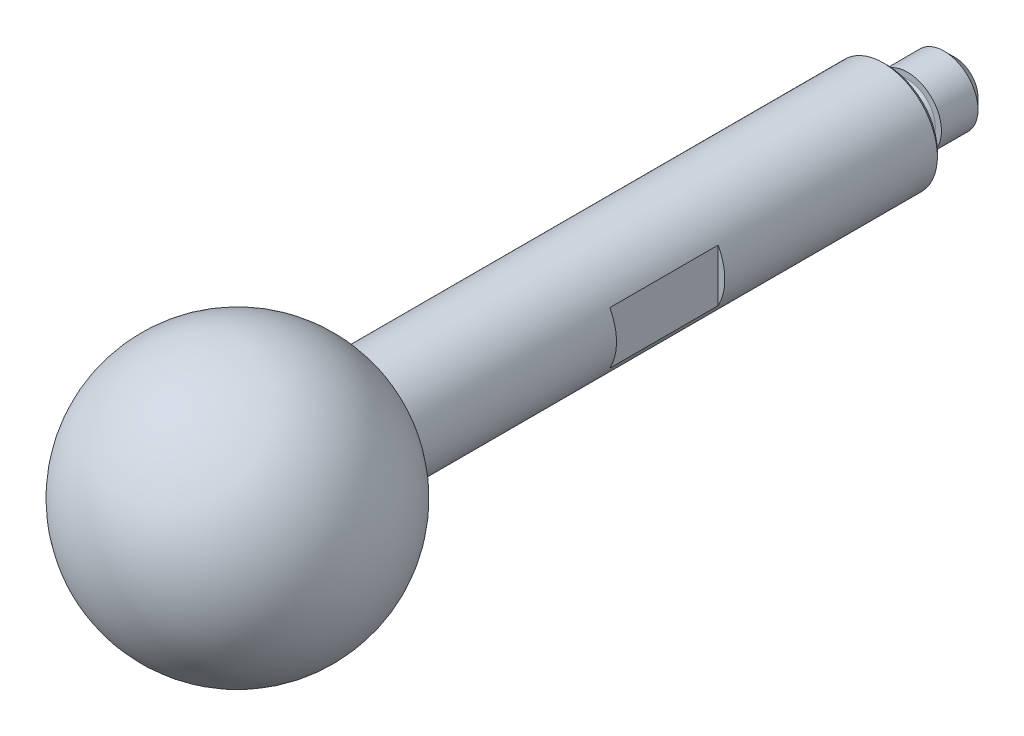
ISO-10303-21;
HEADER;
FILE_DESCRIPTION(('STEP AP214'),'2;1');
FILE_NAME('part.step','',(''),(''),'','','');
FILE_SCHEMA(('AUTOMOTIVE_DESIGN { 1 0 10303 214 1 1 1 1 }'));
ENDSEC;
DATA;
#1=APPLICATION_CONTEXT('core data for automotive mechanical design processes');
#2=APPLICATION_PROTOCOL_DEFINITION('international standard','automotive_design',2000,#1);
#3=PRODUCT_CONTEXT('',#1,'mechanical');
#4=PRODUCT('Part','Part','',(#3));
#5=PRODUCT_RELATED_PRODUCT_CATEGORY('part','',(#4));
#6=PRODUCT_DEFINITION_FORMATION('','',#4);
#7=PRODUCT_DEFINITION_CONTEXT('part definition',#1,'design');
#8=PRODUCT_DEFINITION('design','',#6,#7);
#9=PRODUCT_DEFINITION_SHAPE('','',#8);
#10=(LENGTH_UNIT() NAMED_UNIT(*) SI_UNIT(.MILLI.,.METRE.));
#11=(NAMED_UNIT(*) PLANE_ANGLE_UNIT() SI_UNIT($,.RADIAN.));
#12=(NAMED_UNIT(*) SI_UNIT($,.STERADIAN.) SOLID_ANGLE_UNIT());
#13=UNCERTAINTY_MEASURE_WITH_UNIT(LENGTH_MEASURE(1.E-05),#10,'distance_accuracy_value','');
#14=(GEOMETRIC_REPRESENTATION_CONTEXT(3) GLOBAL_UNCERTAINTY_ASSIGNED_CONTEXT((#13)) GLOBAL_UNIT_ASSIGNED_CONTEXT((#10,
#11,#12)) REPRESENTATION_CONTEXT('',''));
#15=CARTESIAN_POINT('',(0.,0.,0.));
#16=DIRECTION('',(0.,0.,1.));
#17=DIRECTION('',(1.,0.,0.));
#18=AXIS2_PLACEMENT_3D('',#15,#16,#17);
#19=CARTESIAN_POINT('',(0.,0.,0.));
#20=DIRECTION('',(0.,0.,-1.));
#21=DIRECTION('',(-1.,0.,0.));
#22=AXIS2_PLACEMENT_3D('',#19,#20,#21);
#23=PLANE('',#22);
#24=CARTESIAN_POINT('',(0.,0.,0.));
#25=DIRECTION('',(0.,0.,-1.));
#26=DIRECTION('',(-1.,0.,0.));
#27=AXIS2_PLACEMENT_3D('',#24,#25,#26);
#28=CIRCLE('',#27,3.7);
#29=CARTESIAN_POINT('',(-3.7,0.,0.));
#30=VERTEX_POINT('',#29);
#31=EDGE_CURVE('E22',#30,#30,#28,.T.);
#32=ORIENTED_EDGE('',*,*,#31,.T.);
#33=EDGE_LOOP('',(#32));
#34=FACE_BOUND('',#33,.T.);
#35=CARTESIAN_POINT('',(0.,0.,0.));
#36=DIRECTION('',(0.,0.,-1.));
#37=DIRECTION('',(-1.,0.,0.));
#38=AXIS2_PLACEMENT_3D('',#35,#36,#37);
#39=CIRCLE('',#38,2.05);
#40=CARTESIAN_POINT('',(-2.05,0.,0.));
#41=VERTEX_POINT('',#40);
#42=EDGE_CURVE('E81',#41,#41,#39,.T.);
#43=ORIENTED_EDGE('',*,*,#42,.F.);
#44=EDGE_LOOP('',(#43));
#45=FACE_BOUND('',#44,.T.);
#46=ADVANCED_FACE('F14',(#34,#45),#23,.T.);
#47=CARTESIAN_POINT('',(5.66262459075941,1.98360347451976,40.));
#48=DIRECTION('',(0.,0.,1.));
#49=DIRECTION('',(0.330600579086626,-0.943770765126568,0.));
#50=AXIS2_PLACEMENT_3D('',#47,#48,#49);
#51=PLANE('',#50);
#52=CARTESIAN_POINT('',(0.,0.,40.));
#53=DIRECTION('',(0.,0.,-1.));
#54=DIRECTION('',(-0.330600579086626,0.943770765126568,0.));
#55=AXIS2_PLACEMENT_3D('',#52,#53,#54);
#56=CIRCLE('',#55,6.);
#57=CARTESIAN_POINT('',(-1.98360347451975,5.66262459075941,40.));
#58=VERTEX_POINT('',#57);
#59=EDGE_CURVE('E72',#58,#58,#56,.T.);
#60=ORIENTED_EDGE('',*,*,#59,.T.);
#61=EDGE_LOOP('',(#60));
#62=FACE_BOUND('',#61,.T.);
#63=CARTESIAN_POINT('',(0.,0.,40.));
#64=DIRECTION('',(0.,0.,-1.));
#65=DIRECTION('',(-1.,0.,0.));
#66=AXIS2_PLACEMENT_3D('',#63,#64,#65);
#67=CIRCLE('',#66,4.);
#68=CARTESIAN_POINT('',(-4.,0.,40.));
#69=VERTEX_POINT('',#68);
#70=EDGE_CURVE('E75',#69,#69,#67,.T.);
#71=ORIENTED_EDGE('',*,*,#70,.F.);
#72=EDGE_LOOP('',(#71));
#73=FACE_BOUND('',#72,.T.);
#74=ADVANCED_FACE('F103',(#62,#73),#51,.F.);
#75=CARTESIAN_POINT('',(0.,0.,48.));
#76=DIRECTION('',(0.,0.,-1.));
#77=DIRECTION('',(0.943770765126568,0.330600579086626,0.));
#78=AXIS2_PLACEMENT_3D('',#75,#76,#77);
#79=SPHERICAL_SURFACE('',#78,10.);
#80=ORIENTED_EDGE('',*,*,#59,.F.);
#81=EDGE_LOOP('',(#80));
#82=FACE_BOUND('',#81,.T.);
#83=ADVANCED_FACE('F108',(#82),#79,.T.);
#84=CARTESIAN_POINT('',(3.5,2.,24.));
#85=DIRECTION('',(0.,0.,-1.));
#86=DIRECTION('',(-1.,0.,0.));
#87=AXIS2_PLACEMENT_3D('',#84,#85,#86);
#88=PLANE('',#87);
#89=DIRECTION('',(0.,1.,0.));
#90=VECTOR('',#89,1.);
#91=CARTESIAN_POINT('',(3.5,2.,24.));
#92=LINE('',#91,#90);
#93=CARTESIAN_POINT('',(3.5,-1.93649167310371,24.));
#94=VERTEX_POINT('',#93);
#95=CARTESIAN_POINT('',(3.5,1.93649167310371,24.));
#96=VERTEX_POINT('',#95);
#97=EDGE_CURVE('E29',#94,#96,#92,.T.);
#98=ORIENTED_EDGE('',*,*,#97,.T.);
#99=CARTESIAN_POINT('',(0.,0.,24.));
#100=DIRECTION('',(0.,0.,-1.));
#101=DIRECTION('',(-1.,0.,0.));
#102=AXIS2_PLACEMENT_3D('',#99,#100,#101);
#103=CIRCLE('',#102,4.);
#104=EDGE_CURVE('E65',#96,#94,#103,.T.);
#105=ORIENTED_EDGE('',*,*,#104,.T.);
#106=EDGE_LOOP('',(#98,#105));
#107=FACE_BOUND('',#106,.T.);
#108=ADVANCED_FACE('F130',(#107),#88,.T.);
#109=CARTESIAN_POINT('',(3.5,2.,16.));
#110=DIRECTION('',(0.,0.,1.));
#111=DIRECTION('',(1.,0.,0.));
#112=AXIS2_PLACEMENT_3D('',#109,#110,#111);
#113=PLANE('',#112);
#114=CARTESIAN_POINT('',(0.,0.,16.));
#115=DIRECTION('',(0.,0.,1.));
#116=DIRECTION('',(1.,0.,0.));
#117=AXIS2_PLACEMENT_3D('',#114,#115,#116);
#118=CIRCLE('',#117,4.);
#119=CARTESIAN_POINT('',(3.5,-1.93649167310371,16.));
#120=VERTEX_POINT('',#119);
#121=CARTESIAN_POINT('',(3.5,1.93649167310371,16.));
#122=VERTEX_POINT('',#121);
#123=EDGE_CURVE('E57',#120,#122,#118,.T.);
#124=ORIENTED_EDGE('',*,*,#123,.T.);
#125=DIRECTION('',(0.,-1.,0.));
#126=VECTOR('',#125,1.);
#127=CARTESIAN_POINT('',(3.5,2.,16.));
#128=LINE('',#127,#126);
#129=EDGE_CURVE('E60',#122,#120,#128,.T.);
#130=ORIENTED_EDGE('',*,*,#129,.T.);
#131=EDGE_LOOP('',(#124,#130));
#132=FACE_BOUND('',#131,.T.);
#133=ADVANCED_FACE('F59',(#132),#113,.T.);
#134=CARTESIAN_POINT('',(3.5,-2.,16.));
#135=DIRECTION('',(1.,0.,0.));
#136=DIRECTION('',(0.,0.,1.));
#137=AXIS2_PLACEMENT_3D('',#134,#135,#136);
#138=PLANE('',#137);
#139=DIRECTION('',(0.,0.,1.));
#140=VECTOR('',#139,1.);
#141=CARTESIAN_POINT('',(3.5,1.93649167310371,0.));
#142=LINE('',#141,#140);
#143=EDGE_CURVE('E68',#122,#96,#142,.T.);
#144=ORIENTED_EDGE('',*,*,#143,.T.);
#145=ORIENTED_EDGE('',*,*,#97,.F.);
#146=DIRECTION('',(0.,0.,1.));
#147=VECTOR('',#146,1.);
#148=CARTESIAN_POINT('',(3.5,-1.93649167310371,0.));
#149=LINE('',#148,#147);
#150=EDGE_CURVE('E64',#94,#120,#149,.F.);
#151=ORIENTED_EDGE('',*,*,#150,.T.);
#152=ORIENTED_EDGE('',*,*,#129,.F.);
#153=EDGE_LOOP('',(#144,#145,#151,#152));
#154=FACE_BOUND('',#153,.T.);
#155=ADVANCED_FACE('F67',(#154),#138,.T.);
#156=CARTESIAN_POINT('',(-3.5,2.,24.));
#157=DIRECTION('',(0.,0.,1.));
#158=DIRECTION('',(1.,0.,0.));
#159=AXIS2_PLACEMENT_3D('',#156,#157,#158);
#160=PLANE('',#159);
#161=DIRECTION('',(0.,1.,0.));
#162=VECTOR('',#161,1.);
#163=CARTESIAN_POINT('',(-3.5,2.,24.));
#164=LINE('',#163,#162);
#165=CARTESIAN_POINT('',(-3.5,-1.93649167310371,24.));
#166=VERTEX_POINT('',#165);
#167=CARTESIAN_POINT('',(-3.5,1.93649167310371,24.));
#168=VERTEX_POINT('',#167);
#169=EDGE_CURVE('E172',#166,#168,#164,.T.);
#170=ORIENTED_EDGE('',*,*,#169,.F.);
#171=CARTESIAN_POINT('',(0.,0.,24.));
#172=DIRECTION('',(0.,0.,1.));
#173=DIRECTION('',(1.,0.,0.));
#174=AXIS2_PLACEMENT_3D('',#171,#172,#173);
#175=CIRCLE('',#174,4.);
#176=EDGE_CURVE('E36',#168,#166,#175,.T.);
#177=ORIENTED_EDGE('',*,*,#176,.F.);
#178=EDGE_LOOP('',(#170,#177));
#179=FACE_BOUND('',#178,.T.);
#180=ADVANCED_FACE('F126',(#179),#160,.F.);
#181=CARTESIAN_POINT('',(-3.5,-2.,16.));
#182=DIRECTION('',(-1.,0.,0.));
#183=DIRECTION('',(0.,0.,1.));
#184=AXIS2_PLACEMENT_3D('',#181,#182,#183);
#185=PLANE('',#184);
#186=DIRECTION('',(0.,0.,1.));
#187=VECTOR('',#186,1.);
#188=CARTESIAN_POINT('',(-3.5,-1.93649167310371,0.));
#189=LINE('',#188,#187);
#190=CARTESIAN_POINT('',(-3.5,-1.93649167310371,16.));
#191=VERTEX_POINT('',#190);
#192=EDGE_CURVE('E179',#191,#166,#189,.T.);
#193=ORIENTED_EDGE('',*,*,#192,.T.);
#194=ORIENTED_EDGE('',*,*,#169,.T.);
#195=DIRECTION('',(0.,0.,1.));
#196=VECTOR('',#195,1.);
#197=CARTESIAN_POINT('',(-3.5,1.93649167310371,0.));
#198=LINE('',#197,#196);
#199=CARTESIAN_POINT('',(-3.5,1.93649167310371,16.));
#200=VERTEX_POINT('',#199);
#201=EDGE_CURVE('E180',#168,#200,#198,.F.);
#202=ORIENTED_EDGE('',*,*,#201,.T.);
#203=DIRECTION('',(0.,-1.,0.));
#204=VECTOR('',#203,1.);
#205=CARTESIAN_POINT('',(-3.5,2.,16.));
#206=LINE('',#205,#204);
#207=EDGE_CURVE('E175',#200,#191,#206,.T.);
#208=ORIENTED_EDGE('',*,*,#207,.T.);
#209=EDGE_LOOP('',(#193,#194,#202,#208));
#210=FACE_BOUND('',#209,.T.);
#211=ADVANCED_FACE('F124',(#210),#185,.T.);
#212=CARTESIAN_POINT('',(-3.5,2.,16.));
#213=DIRECTION('',(0.,0.,-1.));
#214=DIRECTION('',(-1.,0.,0.));
#215=AXIS2_PLACEMENT_3D('',#212,#213,#214);
#216=PLANE('',#215);
#217=CARTESIAN_POINT('',(0.,0.,16.));
#218=DIRECTION('',(0.,0.,-1.));
#219=DIRECTION('',(-1.,0.,0.));
#220=AXIS2_PLACEMENT_3D('',#217,#218,#219);
#221=CIRCLE('',#220,4.);
#222=EDGE_CURVE('E181',#191,#200,#221,.T.);
#223=ORIENTED_EDGE('',*,*,#222,.F.);
#224=ORIENTED_EDGE('',*,*,#207,.F.);
#225=EDGE_LOOP('',(#223,#224));
#226=FACE_BOUND('',#225,.T.);
#227=ADVANCED_FACE('F115',(#226),#216,.F.);
#228=CARTESIAN_POINT('',(0.,0.,0.));
#229=DIRECTION('',(0.,0.,1.));
#230=DIRECTION('',(1.,0.,0.));
#231=AXIS2_PLACEMENT_3D('',#228,#229,#230);
#232=CYLINDRICAL_SURFACE('',#231,4.);
#233=CARTESIAN_POINT('',(0.,0.,0.3));
#234=DIRECTION('',(0.,0.,-1.));
#235=DIRECTION('',(-1.,0.,0.));
#236=AXIS2_PLACEMENT_3D('',#233,#234,#235);
#237=CIRCLE('',#236,4.);
#238=CARTESIAN_POINT('',(-4.,0.,0.3));
#239=VERTEX_POINT('',#238);
#240=EDGE_CURVE('E9',#239,#239,#237,.F.);
#241=ORIENTED_EDGE('',*,*,#240,.T.);
#242=EDGE_LOOP('',(#241));
#243=FACE_BOUND('',#242,.T.);
#244=ORIENTED_EDGE('',*,*,#222,.T.);
#245=ORIENTED_EDGE('',*,*,#201,.F.);
#246=ORIENTED_EDGE('',*,*,#176,.T.);
#247=ORIENTED_EDGE('',*,*,#192,.F.);
#248=EDGE_LOOP('',(#244,#245,#246,#247));
#249=FACE_BOUND('',#248,.T.);
#250=ORIENTED_EDGE('',*,*,#70,.T.);
#251=EDGE_LOOP('',(#250));
#252=FACE_BOUND('',#251,.T.);
#253=ORIENTED_EDGE('',*,*,#143,.F.);
#254=ORIENTED_EDGE('',*,*,#123,.F.);
#255=ORIENTED_EDGE('',*,*,#150,.F.);
#256=ORIENTED_EDGE('',*,*,#104,.F.);
#257=EDGE_LOOP('',(#253,#254,#255,#256));
#258=FACE_BOUND('',#257,.T.);
#259=ADVANCED_FACE('F71',(#243,#249,#252,#258),#232,.T.);
#260=CARTESIAN_POINT('',(0.,2.05,-1.5));
#261=DIRECTION('',(0.,0.,-1.));
#262=DIRECTION('',(-1.,0.,0.));
#263=AXIS2_PLACEMENT_3D('',#260,#261,#262);
#264=PLANE('',#263);
#265=CARTESIAN_POINT('',(0.,0.,-1.5));
#266=DIRECTION('',(0.,0.,-1.));
#267=DIRECTION('',(-1.,0.,0.));
#268=AXIS2_PLACEMENT_3D('',#265,#266,#267);
#269=CIRCLE('',#268,2.05);
#270=CARTESIAN_POINT('',(-2.05,0.,-1.5));
#271=VERTEX_POINT('',#270);
#272=EDGE_CURVE('E200',#271,#271,#269,.T.);
#273=ORIENTED_EDGE('',*,*,#272,.T.);
#274=EDGE_LOOP('',(#273));
#275=FACE_BOUND('',#274,.T.);
#276=CARTESIAN_POINT('',(0.,0.,-1.5));
#277=DIRECTION('',(0.,0.,-1.));
#278=DIRECTION('',(-1.,0.,0.));
#279=AXIS2_PLACEMENT_3D('',#276,#277,#278);
#280=CIRCLE('',#279,2.5);
#281=CARTESIAN_POINT('',(-2.5,0.,-1.5));
#282=VERTEX_POINT('',#281);
#283=EDGE_CURVE('E69',#282,#282,#280,.T.);
#284=ORIENTED_EDGE('',*,*,#283,.F.);
#285=EDGE_LOOP('',(#284));
#286=FACE_BOUND('',#285,.T.);
#287=ADVANCED_FACE('F114',(#275,#286),#264,.F.);
#288=CARTESIAN_POINT('',(0.,0.,-0.2));
#289=DIRECTION('',(0.,0.,-1.));
#290=DIRECTION('',(-1.,0.,0.));
#291=AXIS2_PLACEMENT_3D('',#288,#289,#290);
#292=TOROIDAL_SURFACE('',#291,2.05,0.2);
#293=CARTESIAN_POINT('',(0.,0.,-0.2));
#294=DIRECTION('',(0.,0.,-1.));
#295=DIRECTION('',(-1.,0.,0.));
#296=AXIS2_PLACEMENT_3D('',#293,#294,#295);
#297=CIRCLE('',#296,1.85);
#298=CARTESIAN_POINT('',(-1.85,0.,-0.2));
#299=VERTEX_POINT('',#298);
#300=EDGE_CURVE('E194',#299,#299,#297,.T.);
#301=ORIENTED_EDGE('',*,*,#300,.F.);
#302=EDGE_LOOP('',(#301));
#303=FACE_BOUND('',#302,.T.);
#304=ORIENTED_EDGE('',*,*,#42,.T.);
#305=EDGE_LOOP('',(#304));
#306=FACE_BOUND('',#305,.T.);
#307=ADVANCED_FACE('F121',(#303,#306),#292,.F.);
#308=CARTESIAN_POINT('',(0.,0.,-5.));
#309=DIRECTION('',(0.,0.,-1.));
#310=DIRECTION('',(-1.,0.,0.));
#311=AXIS2_PLACEMENT_3D('',#308,#309,#310);
#312=CYLINDRICAL_SURFACE('',#311,1.85);
#313=CARTESIAN_POINT('',(0.,0.,-1.3));
#314=DIRECTION('',(0.,0.,-1.));
#315=DIRECTION('',(-1.,0.,0.));
#316=AXIS2_PLACEMENT_3D('',#313,#314,#315);
#317=CIRCLE('',#316,1.85);
#318=CARTESIAN_POINT('',(-1.85,0.,-1.3));
#319=VERTEX_POINT('',#318);
#320=EDGE_CURVE('E197',#319,#319,#317,.T.);
#321=ORIENTED_EDGE('',*,*,#320,.F.);
#322=EDGE_LOOP('',(#321));
#323=FACE_BOUND('',#322,.T.);
#324=ORIENTED_EDGE('',*,*,#300,.T.);
#325=EDGE_LOOP('',(#324));
#326=FACE_BOUND('',#325,.T.);
#327=ADVANCED_FACE('F143',(#323,#326),#312,.T.);
#328=CARTESIAN_POINT('',(0.,0.,-1.3));
#329=DIRECTION('',(0.,0.,-1.));
#330=DIRECTION('',(-1.,0.,0.));
#331=AXIS2_PLACEMENT_3D('',#328,#329,#330);
#332=TOROIDAL_SURFACE('',#331,2.05,0.2);
#333=ORIENTED_EDGE('',*,*,#272,.F.);
#334=EDGE_LOOP('',(#333));
#335=FACE_BOUND('',#334,.T.);
#336=ORIENTED_EDGE('',*,*,#320,.T.);
#337=EDGE_LOOP('',(#336));
#338=FACE_BOUND('',#337,.T.);
#339=ADVANCED_FACE('F138',(#335,#338),#332,.F.);
#340=CARTESIAN_POINT('',(0.,0.,-5.));
#341=DIRECTION('',(0.,0.,1.));
#342=DIRECTION('',(0.,-1.,0.));
#343=AXIS2_PLACEMENT_3D('',#340,#341,#342);
#344=PLANE('',#343);
#345=CARTESIAN_POINT('',(0.,0.,-5.));
#346=DIRECTION('',(0.,0.,1.));
#347=DIRECTION('',(1.,0.,0.));
#348=AXIS2_PLACEMENT_3D('',#345,#346,#347);
#349=CIRCLE('',#348,1.7);
#350=CARTESIAN_POINT('',(1.7,0.,-5.));
#351=VERTEX_POINT('',#350);
#352=EDGE_CURVE('E82',#351,#351,#349,.F.);
#353=ORIENTED_EDGE('',*,*,#352,.T.);
#354=EDGE_LOOP('',(#353));
#355=FACE_BOUND('',#354,.T.);
#356=ADVANCED_FACE('F135',(#355),#344,.F.);
#357=CARTESIAN_POINT('',(0.,0.,15.));
#358=DIRECTION('',(0.,0.,1.));
#359=DIRECTION('',(0.,-1.,0.));
#360=AXIS2_PLACEMENT_3D('',#357,#358,#359);
#361=CYLINDRICAL_SURFACE('',#360,2.5);
#362=CARTESIAN_POINT('',(0.,0.,-4.2));
#363=DIRECTION('',(0.,0.,1.));
#364=DIRECTION('',(1.,0.,0.));
#365=AXIS2_PLACEMENT_3D('',#362,#363,#364);
#366=CIRCLE('',#365,2.5);
#367=CARTESIAN_POINT('',(2.5,0.,-4.2));
#368=VERTEX_POINT('',#367);
#369=EDGE_CURVE('E85',#368,#368,#366,.T.);
#370=ORIENTED_EDGE('',*,*,#369,.T.);
#371=EDGE_LOOP('',(#370));
#372=FACE_BOUND('',#371,.T.);
#373=ORIENTED_EDGE('',*,*,#283,.T.);
#374=EDGE_LOOP('',(#373));
#375=FACE_BOUND('',#374,.T.);
#376=ADVANCED_FACE('F99',(#372,#375),#361,.T.);
#377=CARTESIAN_POINT('',(0.,0.,-5.));
#378=DIRECTION('',(0.,0.,1.));
#379=DIRECTION('',(1.,0.,0.));
#380=AXIS2_PLACEMENT_3D('',#377,#378,#379);
#381=CONICAL_SURFACE('',#380,1.7,0.785398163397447);
#382=ORIENTED_EDGE('',*,*,#369,.F.);
#383=EDGE_LOOP('',(#382));
#384=FACE_BOUND('',#383,.T.);
#385=ORIENTED_EDGE('',*,*,#352,.F.);
#386=EDGE_LOOP('',(#385));
#387=FACE_BOUND('',#386,.T.);
#388=ADVANCED_FACE('F93',(#384,#387),#381,.T.);
#389=CARTESIAN_POINT('',(0.,0.,0.));
#390=DIRECTION('',(0.,0.,1.));
#391=DIRECTION('',(1.,0.,0.));
#392=AXIS2_PLACEMENT_3D('',#389,#390,#391);
#393=CONICAL_SURFACE('',#392,3.7,0.785398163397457);
#394=ORIENTED_EDGE('',*,*,#240,.F.);
#395=EDGE_LOOP('',(#394));
#396=FACE_BOUND('',#395,.T.);
#397=ORIENTED_EDGE('',*,*,#31,.F.);
#398=EDGE_LOOP('',(#397));
#399=FACE_BOUND('',#398,.T.);
#400=ADVANCED_FACE('F16',(#396,#399),#393,.T.);
#401=CLOSED_SHELL('',(#46,#74,#83,#108,#133,#155,#180,#211,#227,#259,#287,#307,#327,#339,#356,
#376,#388,#400));
#402=MANIFOLD_SOLID_BREP('B1',#401);
#403=ADVANCED_BREP_SHAPE_REPRESENTATION('',(#18,#402),#14);
#404=SHAPE_DEFINITION_REPRESENTATION(#9,#403);
ENDSEC;
END-ISO-10303-21;
